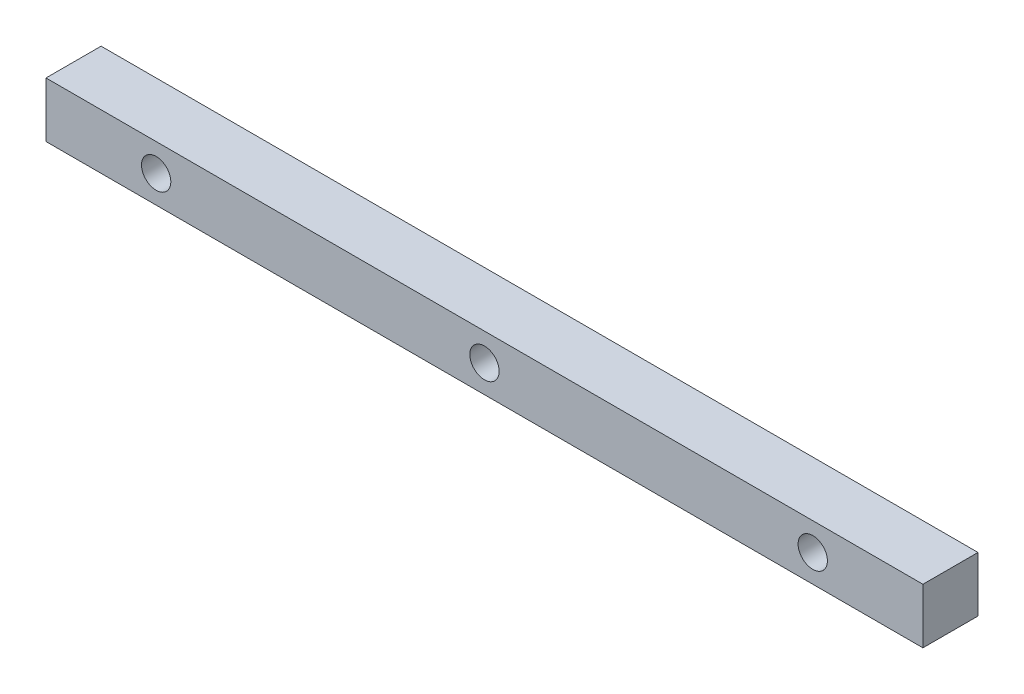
ISO-10303-21;
HEADER;
FILE_DESCRIPTION(('STEP AP214'),'2;1');
FILE_NAME('part.step','',(''),(''),'','','');
FILE_SCHEMA(('AUTOMOTIVE_DESIGN { 1 0 10303 214 1 1 1 1 }'));
ENDSEC;
DATA;
#1=APPLICATION_CONTEXT('core data for automotive mechanical design processes');
#2=APPLICATION_PROTOCOL_DEFINITION('international standard','automotive_design',2000,#1);
#3=PRODUCT_CONTEXT('',#1,'mechanical');
#4=PRODUCT('Part','Part','',(#3));
#5=PRODUCT_RELATED_PRODUCT_CATEGORY('part','',(#4));
#6=PRODUCT_DEFINITION_FORMATION('','',#4);
#7=PRODUCT_DEFINITION_CONTEXT('part definition',#1,'design');
#8=PRODUCT_DEFINITION('design','',#6,#7);
#9=PRODUCT_DEFINITION_SHAPE('','',#8);
#10=(LENGTH_UNIT() NAMED_UNIT(*) SI_UNIT(.MILLI.,.METRE.));
#11=(NAMED_UNIT(*) PLANE_ANGLE_UNIT() SI_UNIT($,.RADIAN.));
#12=(NAMED_UNIT(*) SI_UNIT($,.STERADIAN.) SOLID_ANGLE_UNIT());
#13=UNCERTAINTY_MEASURE_WITH_UNIT(LENGTH_MEASURE(1.E-05),#10,'distance_accuracy_value','');
#14=(GEOMETRIC_REPRESENTATION_CONTEXT(3) GLOBAL_UNCERTAINTY_ASSIGNED_CONTEXT((#13)) GLOBAL_UNIT_ASSIGNED_CONTEXT((#10,
#11,#12)) REPRESENTATION_CONTEXT('',''));
#15=CARTESIAN_POINT('',(0.,0.,0.));
#16=DIRECTION('',(0.,0.,1.));
#17=DIRECTION('',(1.,0.,0.));
#18=AXIS2_PLACEMENT_3D('',#15,#16,#17);
#19=CARTESIAN_POINT('',(0.,-12.7,12.7));
#20=DIRECTION('',(0.,0.,-1.));
#21=DIRECTION('',(-1.,0.,0.));
#22=AXIS2_PLACEMENT_3D('',#19,#20,#21);
#23=PLANE('',#22);
#24=CARTESIAN_POINT('',(-101.092,-6.34999999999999,12.7));
#25=DIRECTION('',(0.,0.,1.));
#26=DIRECTION('',(1.,0.,0.));
#27=AXIS2_PLACEMENT_3D('',#24,#25,#26);
#28=CIRCLE('',#27,3.37819999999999);
#29=CARTESIAN_POINT('',(-97.7138,-6.34999999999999,12.7));
#30=VERTEX_POINT('',#29);
#31=EDGE_CURVE('E145',#30,#30,#28,.T.);
#32=ORIENTED_EDGE('',*,*,#31,.F.);
#33=EDGE_LOOP('',(#32));
#34=FACE_BOUND('',#33,.T.);
#35=DIRECTION('',(0.,1.,0.));
#36=VECTOR('',#35,1.);
#37=CARTESIAN_POINT('',(0.,0.,12.7));
#38=LINE('',#37,#36);
#39=CARTESIAN_POINT('',(0.,-12.7,12.7));
#40=VERTEX_POINT('',#39);
#41=CARTESIAN_POINT('',(0.,0.,12.7));
#42=VERTEX_POINT('',#41);
#43=EDGE_CURVE('E100',#40,#42,#38,.T.);
#44=ORIENTED_EDGE('',*,*,#43,.T.);
#45=DIRECTION('',(-1.,0.,0.));
#46=VECTOR('',#45,1.);
#47=CARTESIAN_POINT('',(0.,0.,12.7));
#48=LINE('',#47,#46);
#49=CARTESIAN_POINT('',(-202.184,0.,12.7));
#50=VERTEX_POINT('',#49);
#51=EDGE_CURVE('E95',#42,#50,#48,.T.);
#52=ORIENTED_EDGE('',*,*,#51,.T.);
#53=DIRECTION('',(0.,-1.,0.));
#54=VECTOR('',#53,1.);
#55=CARTESIAN_POINT('',(-202.184,0.,12.7));
#56=LINE('',#55,#54);
#57=CARTESIAN_POINT('',(-202.184,-12.7,12.7));
#58=VERTEX_POINT('',#57);
#59=EDGE_CURVE('E98',#50,#58,#56,.T.);
#60=ORIENTED_EDGE('',*,*,#59,.T.);
#61=DIRECTION('',(1.,0.,0.));
#62=VECTOR('',#61,1.);
#63=CARTESIAN_POINT('',(0.,-12.7,12.7));
#64=LINE('',#63,#62);
#65=EDGE_CURVE('E65',#58,#40,#64,.T.);
#66=ORIENTED_EDGE('',*,*,#65,.T.);
#67=EDGE_LOOP('',(#44,#52,#60,#66));
#68=FACE_BOUND('',#67,.T.);
#69=CARTESIAN_POINT('',(-25.3999999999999,-6.34999999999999,12.7));
#70=DIRECTION('',(0.,0.,1.));
#71=DIRECTION('',(1.,0.,0.));
#72=AXIS2_PLACEMENT_3D('',#69,#70,#71);
#73=CIRCLE('',#72,3.3782);
#74=CARTESIAN_POINT('',(-22.0217999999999,-6.34999999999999,12.7));
#75=VERTEX_POINT('',#74);
#76=EDGE_CURVE('E121',#75,#75,#73,.T.);
#77=ORIENTED_EDGE('',*,*,#76,.F.);
#78=EDGE_LOOP('',(#77));
#79=FACE_BOUND('',#78,.T.);
#80=CARTESIAN_POINT('',(-176.784,-6.34999999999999,12.7));
#81=DIRECTION('',(0.,0.,1.));
#82=DIRECTION('',(1.,0.,0.));
#83=AXIS2_PLACEMENT_3D('',#80,#81,#82);
#84=CIRCLE('',#83,3.37819999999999);
#85=CARTESIAN_POINT('',(-173.4058,-6.34999999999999,12.7));
#86=VERTEX_POINT('',#85);
#87=EDGE_CURVE('E153',#86,#86,#84,.T.);
#88=ORIENTED_EDGE('',*,*,#87,.F.);
#89=EDGE_LOOP('',(#88));
#90=FACE_BOUND('',#89,.T.);
#91=ADVANCED_FACE('F47',(#34,#68,#79,#90),#23,.F.);
#92=CARTESIAN_POINT('',(0.,-12.7,0.));
#93=DIRECTION('',(0.,0.,-1.));
#94=DIRECTION('',(-1.,0.,0.));
#95=AXIS2_PLACEMENT_3D('',#92,#93,#94);
#96=PLANE('',#95);
#97=CARTESIAN_POINT('',(-101.092,-6.34999999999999,0.));
#98=DIRECTION('',(0.,0.,1.));
#99=DIRECTION('',(1.,0.,0.));
#100=AXIS2_PLACEMENT_3D('',#97,#98,#99);
#101=CIRCLE('',#100,3.37819999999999);
#102=CARTESIAN_POINT('',(-97.7138,-6.34999999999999,0.));
#103=VERTEX_POINT('',#102);
#104=EDGE_CURVE('E149',#103,#103,#101,.T.);
#105=ORIENTED_EDGE('',*,*,#104,.T.);
#106=EDGE_LOOP('',(#105));
#107=FACE_BOUND('',#106,.T.);
#108=DIRECTION('',(0.,1.,0.));
#109=VECTOR('',#108,1.);
#110=CARTESIAN_POINT('',(0.,0.,0.));
#111=LINE('',#110,#109);
#112=CARTESIAN_POINT('',(0.,-12.7,0.));
#113=VERTEX_POINT('',#112);
#114=CARTESIAN_POINT('',(0.,0.,0.));
#115=VERTEX_POINT('',#114);
#116=EDGE_CURVE('E117',#113,#115,#111,.T.);
#117=ORIENTED_EDGE('',*,*,#116,.F.);
#118=DIRECTION('',(1.,0.,0.));
#119=VECTOR('',#118,1.);
#120=CARTESIAN_POINT('',(0.,-12.7,0.));
#121=LINE('',#120,#119);
#122=CARTESIAN_POINT('',(-202.184,-12.7,0.));
#123=VERTEX_POINT('',#122);
#124=EDGE_CURVE('E88',#123,#113,#121,.T.);
#125=ORIENTED_EDGE('',*,*,#124,.F.);
#126=DIRECTION('',(0.,-1.,0.));
#127=VECTOR('',#126,1.);
#128=CARTESIAN_POINT('',(-202.184,0.,0.));
#129=LINE('',#128,#127);
#130=CARTESIAN_POINT('',(-202.184,0.,0.));
#131=VERTEX_POINT('',#130);
#132=EDGE_CURVE('E82',#131,#123,#129,.T.);
#133=ORIENTED_EDGE('',*,*,#132,.F.);
#134=DIRECTION('',(-1.,0.,0.));
#135=VECTOR('',#134,1.);
#136=CARTESIAN_POINT('',(0.,0.,0.));
#137=LINE('',#136,#135);
#138=EDGE_CURVE('E105',#115,#131,#137,.T.);
#139=ORIENTED_EDGE('',*,*,#138,.F.);
#140=EDGE_LOOP('',(#117,#125,#133,#139));
#141=FACE_BOUND('',#140,.T.);
#142=CARTESIAN_POINT('',(-25.3999999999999,-6.34999999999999,0.));
#143=DIRECTION('',(0.,0.,1.));
#144=DIRECTION('',(1.,0.,0.));
#145=AXIS2_PLACEMENT_3D('',#142,#143,#144);
#146=CIRCLE('',#145,3.3782);
#147=CARTESIAN_POINT('',(-22.0217999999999,-6.34999999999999,0.));
#148=VERTEX_POINT('',#147);
#149=EDGE_CURVE('E141',#148,#148,#146,.T.);
#150=ORIENTED_EDGE('',*,*,#149,.T.);
#151=EDGE_LOOP('',(#150));
#152=FACE_BOUND('',#151,.T.);
#153=CARTESIAN_POINT('',(-176.784,-6.34999999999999,0.));
#154=DIRECTION('',(0.,0.,1.));
#155=DIRECTION('',(1.,0.,0.));
#156=AXIS2_PLACEMENT_3D('',#153,#154,#155);
#157=CIRCLE('',#156,3.37819999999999);
#158=CARTESIAN_POINT('',(-173.4058,-6.34999999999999,0.));
#159=VERTEX_POINT('',#158);
#160=EDGE_CURVE('E157',#159,#159,#157,.T.);
#161=ORIENTED_EDGE('',*,*,#160,.T.);
#162=EDGE_LOOP('',(#161));
#163=FACE_BOUND('',#162,.T.);
#164=ADVANCED_FACE('F135',(#107,#141,#152,#163),#96,.T.);
#165=CARTESIAN_POINT('',(0.,0.,12.7));
#166=DIRECTION('',(-1.,0.,0.));
#167=DIRECTION('',(0.,-1.,0.));
#168=AXIS2_PLACEMENT_3D('',#165,#166,#167);
#169=PLANE('',#168);
#170=ORIENTED_EDGE('',*,*,#116,.T.);
#171=DIRECTION('',(0.,0.,-1.));
#172=VECTOR('',#171,1.);
#173=CARTESIAN_POINT('',(0.,0.,12.7));
#174=LINE('',#173,#172);
#175=EDGE_CURVE('E11',#42,#115,#174,.T.);
#176=ORIENTED_EDGE('',*,*,#175,.F.);
#177=ORIENTED_EDGE('',*,*,#43,.F.);
#178=DIRECTION('',(0.,0.,-1.));
#179=VECTOR('',#178,1.);
#180=CARTESIAN_POINT('',(0.,-12.7,12.7));
#181=LINE('',#180,#179);
#182=EDGE_CURVE('E113',#40,#113,#181,.T.);
#183=ORIENTED_EDGE('',*,*,#182,.T.);
#184=EDGE_LOOP('',(#170,#176,#177,#183));
#185=FACE_BOUND('',#184,.T.);
#186=ADVANCED_FACE('F49',(#185),#169,.F.);
#187=CARTESIAN_POINT('',(0.,0.,12.7));
#188=DIRECTION('',(0.,-1.,0.));
#189=DIRECTION('',(0.,0.,-1.));
#190=AXIS2_PLACEMENT_3D('',#187,#188,#189);
#191=PLANE('',#190);
#192=ORIENTED_EDGE('',*,*,#138,.T.);
#193=DIRECTION('',(0.,0.,-1.));
#194=VECTOR('',#193,1.);
#195=CARTESIAN_POINT('',(-202.184,0.,12.7));
#196=LINE('',#195,#194);
#197=EDGE_CURVE('E57',#50,#131,#196,.T.);
#198=ORIENTED_EDGE('',*,*,#197,.F.);
#199=ORIENTED_EDGE('',*,*,#51,.F.);
#200=ORIENTED_EDGE('',*,*,#175,.T.);
#201=EDGE_LOOP('',(#192,#198,#199,#200));
#202=FACE_BOUND('',#201,.T.);
#203=ADVANCED_FACE('F104',(#202),#191,.F.);
#204=CARTESIAN_POINT('',(-202.184,0.,12.7));
#205=DIRECTION('',(1.,0.,0.));
#206=DIRECTION('',(0.,0.,-1.));
#207=AXIS2_PLACEMENT_3D('',#204,#205,#206);
#208=PLANE('',#207);
#209=ORIENTED_EDGE('',*,*,#132,.T.);
#210=DIRECTION('',(0.,0.,-1.));
#211=VECTOR('',#210,1.);
#212=CARTESIAN_POINT('',(-202.184,-12.7,12.7));
#213=LINE('',#212,#211);
#214=EDGE_CURVE('E107',#58,#123,#213,.T.);
#215=ORIENTED_EDGE('',*,*,#214,.F.);
#216=ORIENTED_EDGE('',*,*,#59,.F.);
#217=ORIENTED_EDGE('',*,*,#197,.T.);
#218=EDGE_LOOP('',(#209,#215,#216,#217));
#219=FACE_BOUND('',#218,.T.);
#220=ADVANCED_FACE('F108',(#219),#208,.F.);
#221=CARTESIAN_POINT('',(0.,-12.7,12.7));
#222=DIRECTION('',(0.,1.,0.));
#223=DIRECTION('',(-1.,0.,0.));
#224=AXIS2_PLACEMENT_3D('',#221,#222,#223);
#225=PLANE('',#224);
#226=ORIENTED_EDGE('',*,*,#124,.T.);
#227=ORIENTED_EDGE('',*,*,#182,.F.);
#228=ORIENTED_EDGE('',*,*,#65,.F.);
#229=ORIENTED_EDGE('',*,*,#214,.T.);
#230=EDGE_LOOP('',(#226,#227,#228,#229));
#231=FACE_BOUND('',#230,.T.);
#232=ADVANCED_FACE('F132',(#231),#225,.F.);
#233=CARTESIAN_POINT('',(-25.3999999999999,-6.34999999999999,12.7));
#234=DIRECTION('',(0.,0.,-1.));
#235=DIRECTION('',(-1.,0.,0.));
#236=AXIS2_PLACEMENT_3D('',#233,#234,#235);
#237=CYLINDRICAL_SURFACE('',#236,3.3782);
#238=ORIENTED_EDGE('',*,*,#76,.T.);
#239=EDGE_LOOP('',(#238));
#240=FACE_BOUND('',#239,.T.);
#241=ORIENTED_EDGE('',*,*,#149,.F.);
#242=EDGE_LOOP('',(#241));
#243=FACE_BOUND('',#242,.T.);
#244=ADVANCED_FACE('F179',(#240,#243),#237,.F.);
#245=CARTESIAN_POINT('',(-101.092,-6.34999999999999,12.7));
#246=DIRECTION('',(0.,0.,-1.));
#247=DIRECTION('',(-1.,0.,0.));
#248=AXIS2_PLACEMENT_3D('',#245,#246,#247);
#249=CYLINDRICAL_SURFACE('',#248,3.37819999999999);
#250=ORIENTED_EDGE('',*,*,#31,.T.);
#251=EDGE_LOOP('',(#250));
#252=FACE_BOUND('',#251,.T.);
#253=ORIENTED_EDGE('',*,*,#104,.F.);
#254=EDGE_LOOP('',(#253));
#255=FACE_BOUND('',#254,.T.);
#256=ADVANCED_FACE('F214',(#252,#255),#249,.F.);
#257=CARTESIAN_POINT('',(-176.784,-6.34999999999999,12.7));
#258=DIRECTION('',(0.,0.,-1.));
#259=DIRECTION('',(-1.,0.,0.));
#260=AXIS2_PLACEMENT_3D('',#257,#258,#259);
#261=CYLINDRICAL_SURFACE('',#260,3.37819999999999);
#262=ORIENTED_EDGE('',*,*,#87,.T.);
#263=EDGE_LOOP('',(#262));
#264=FACE_BOUND('',#263,.T.);
#265=ORIENTED_EDGE('',*,*,#160,.F.);
#266=EDGE_LOOP('',(#265));
#267=FACE_BOUND('',#266,.T.);
#268=ADVANCED_FACE('F166',(#264,#267),#261,.F.);
#269=CLOSED_SHELL('',(#91,#164,#186,#203,#220,#232,#244,#256,#268));
#270=MANIFOLD_SOLID_BREP('B2',#269);
#271=ADVANCED_BREP_SHAPE_REPRESENTATION('',(#18,#270),#14);
#272=SHAPE_DEFINITION_REPRESENTATION(#9,#271);
ENDSEC;
END-ISO-10303-21;
